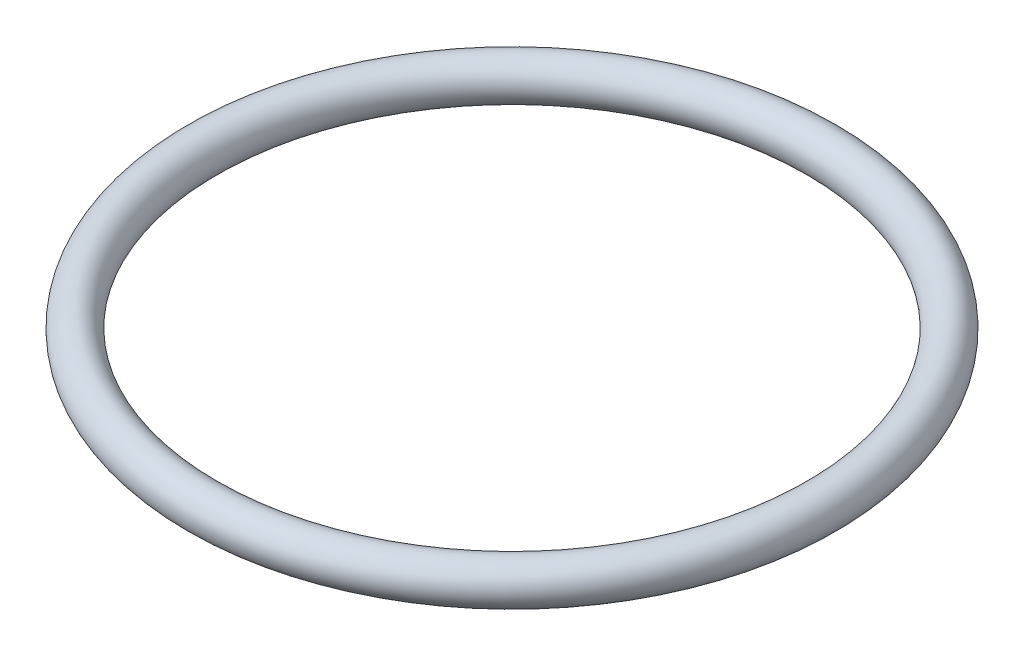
ISO-10303-21;
HEADER;
FILE_DESCRIPTION(('STEP AP214'),'2;1');
FILE_NAME('part.step','',(''),(''),'','','');
FILE_SCHEMA(('AUTOMOTIVE_DESIGN { 1 0 10303 214 1 1 1 1 }'));
ENDSEC;
DATA;
#1=APPLICATION_CONTEXT('core data for automotive mechanical design processes');
#2=APPLICATION_PROTOCOL_DEFINITION('international standard','automotive_design',2000,#1);
#3=PRODUCT_CONTEXT('',#1,'mechanical');
#4=PRODUCT('Part','Part','',(#3));
#5=PRODUCT_RELATED_PRODUCT_CATEGORY('part','',(#4));
#6=PRODUCT_DEFINITION_FORMATION('','',#4);
#7=PRODUCT_DEFINITION_CONTEXT('part definition',#1,'design');
#8=PRODUCT_DEFINITION('design','',#6,#7);
#9=PRODUCT_DEFINITION_SHAPE('','',#8);
#10=(LENGTH_UNIT() NAMED_UNIT(*) SI_UNIT(.MILLI.,.METRE.));
#11=(NAMED_UNIT(*) PLANE_ANGLE_UNIT() SI_UNIT($,.RADIAN.));
#12=(NAMED_UNIT(*) SI_UNIT($,.STERADIAN.) SOLID_ANGLE_UNIT());
#13=UNCERTAINTY_MEASURE_WITH_UNIT(LENGTH_MEASURE(1.E-05),#10,'distance_accuracy_value','');
#14=(GEOMETRIC_REPRESENTATION_CONTEXT(3) GLOBAL_UNCERTAINTY_ASSIGNED_CONTEXT((#13)) GLOBAL_UNIT_ASSIGNED_CONTEXT((#10,
#11,#12)) REPRESENTATION_CONTEXT('',''));
#15=CARTESIAN_POINT('',(0.,0.,0.));
#16=DIRECTION('',(0.,0.,1.));
#17=DIRECTION('',(1.,0.,0.));
#18=AXIS2_PLACEMENT_3D('',#15,#16,#17);
#19=CARTESIAN_POINT('',(0.,-0.640000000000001,0.));
#20=DIRECTION('',(0.,1.,0.));
#21=DIRECTION('',(0.,0.,1.));
#22=AXIS2_PLACEMENT_3D('',#19,#20,#21);
#23=TOROIDAL_SURFACE('',#22,13.45,0.89);
#24=CARTESIAN_POINT('',(0.,-0.640000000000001,14.34));
#25=VERTEX_POINT('',#24);
#26=VERTEX_LOOP('',#25);
#27=FACE_BOUND('',#26,.T.);
#28=ADVANCED_FACE('F24',(#27),#23,.T.);
#29=CLOSED_SHELL('',(#28));
#30=MANIFOLD_SOLID_BREP('B2',#29);
#31=ADVANCED_BREP_SHAPE_REPRESENTATION('',(#18,#30),#14);
#32=SHAPE_DEFINITION_REPRESENTATION(#9,#31);
ENDSEC;
END-ISO-10303-21;
